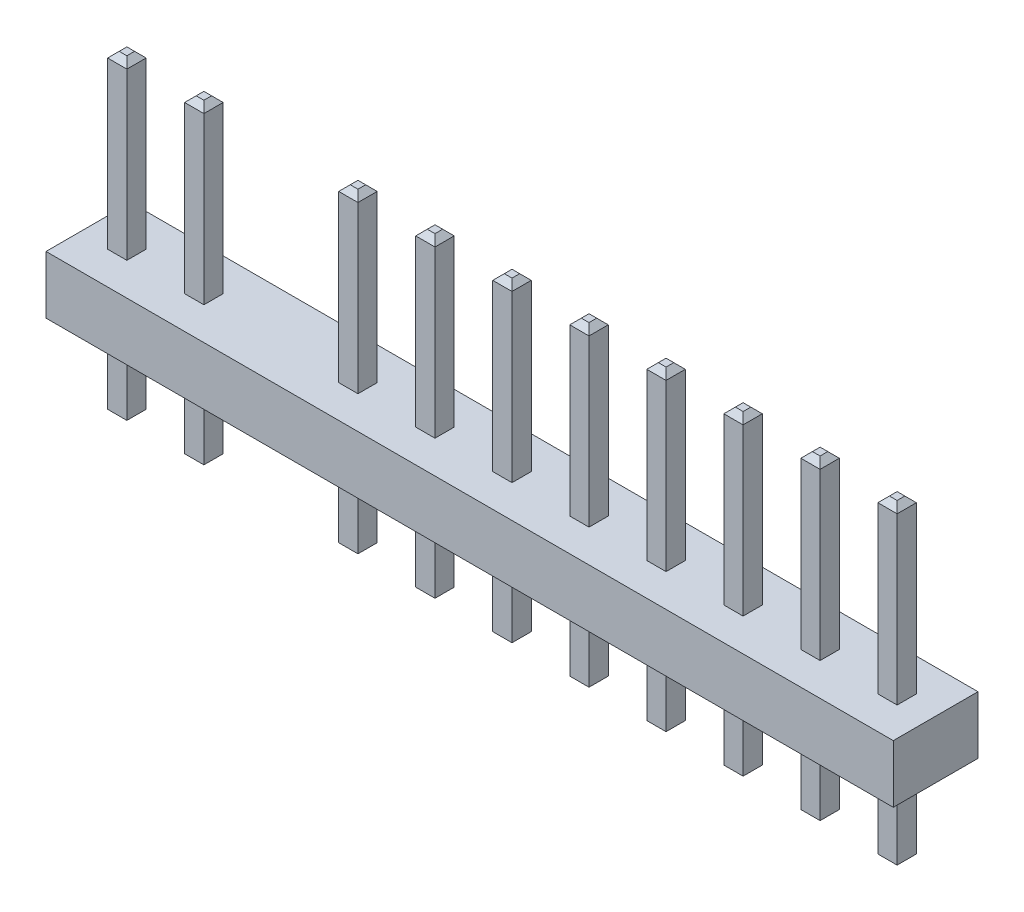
from build123d import *

# Parameters (mm, degrees)
SKETCH1_W                  = 22
SKETCH1_H                  = 2.2
BOSS_EXTRUDE1_DEPTH        = 1.5
BOSS_EXTRUDE2_START        = -3.75
SKETCH2_W                  = 0.5
SKETCH2_H                  = 0.5
BOSS_EXTRUDE2_DEPTH        = 8.2
CHAMFER1_SIZE              = 0.15
LPATTERN1_COUNT            = 11
LPATTERN1_PITCH            = 2
CHAMFER1_OF_LPATTERN1_SIZE = 0.15


with BuildPart() as part:
    # Sketch1 → Boss-Extrude1 (new body)
    with BuildSketch(Plane(origin=(0, 0, 0), x_dir=(1, 0, 0), z_dir=(0, 1, 0))):
        with Locations((11, 1.1)):
            Rectangle(SKETCH1_W, SKETCH1_H)
    extrude(amount=-BOSS_EXTRUDE1_DEPTH)

    # Sketch2 → Boss-Extrude2 (add)
    with BuildSketch(Plane(origin=(0, 0, 0), x_dir=(1, 0, 0), z_dir=(0, 1, 0)).offset(BOSS_EXTRUDE2_START)):
        with Locations((1, 1.1)):
            Rectangle(SKETCH2_W, SKETCH2_H)
    boss_extrude2 = extrude(amount=BOSS_EXTRUDE2_DEPTH)

    # Chamfer1
    chamfer1_edges = [part.edges().sort_by_distance(p)[0] for p in [
        (0.75, -3.75, -1.1),
        (1, -3.75, -1.35),
        (1.25, -3.75, -1.1),
        (1, -3.75, -0.85),
        (0.75, 4.45, -1.1),
        (1, 4.45, -0.85),
        (1.25, 4.45, -1.1),
        (1, 4.45, -1.35),
    ]]
    chamfer(chamfer1_edges, length=CHAMFER1_SIZE)

    # LPattern1: Boss-Extrude2 ×11, 1 skipped
    with Locations(*[(i * LPATTERN1_PITCH, 0, 0) for i in range(1, LPATTERN1_COUNT) if i not in (2,)]):
        add(boss_extrude2)

    # Chamfer1 of LPattern1
    chamfer1_of_lpattern1_edges = [part.edges().sort_by_distance(p)[0] for p in [
        (2.75, -3.75, -1.1),
        (3, -3.75, -1.35),
        (3.25, -3.75, -1.1),
        (3, -3.75, -0.85),
        (2.75, 4.45, -1.1),
        (3, 4.45, -0.85),
        (3.25, 4.45, -1.1),
        (3, 4.45, -1.35),
        (6.75, -3.75, -1.1),
        (7, -3.75, -1.35),
        (7.25, -3.75, -1.1),
        (7, -3.75, -0.85),
        (6.75, 4.45, -1.1),
        (7, 4.45, -0.85),
        (7.25, 4.45, -1.1),
        (7, 4.45, -1.35),
        (8.75, -3.75, -1.1),
        (9, -3.75, -1.35),
        (9.25, -3.75, -1.1),
        (9, -3.75, -0.85),
        (8.75, 4.45, -1.1),
        (9, 4.45, -0.85),
        (9.25, 4.45, -1.1),
        (9, 4.45, -1.35),
        (10.75, -3.75, -1.1),
        (11, -3.75, -1.35),
        (11.25, -3.75, -1.1),
        (11, -3.75, -0.85),
        (10.75, 4.45, -1.1),
        (11, 4.45, -0.85),
        (11.25, 4.45, -1.1),
        (11, 4.45, -1.35),
        (12.75, -3.75, -1.1),
        (13, -3.75, -1.35),
        (13.25, -3.75, -1.1),
        (13, -3.75, -0.85),
        (12.75, 4.45, -1.1),
        (13, 4.45, -0.85),
        (13.25, 4.45, -1.1),
        (13, 4.45, -1.35),
        (14.75, -3.75, -1.1),
        (15, -3.75, -1.35),
        (15.25, -3.75, -1.1),
        (15, -3.75, -0.85),
        (14.75, 4.45, -1.1),
        (15, 4.45, -0.85),
        (15.25, 4.45, -1.1),
        (15, 4.45, -1.35),
        (16.75, -3.75, -1.1),
        (17, -3.75, -1.35),
        (17.25, -3.75, -1.1),
        (17, -3.75, -0.85),
        (16.75, 4.45, -1.1),
        (17, 4.45, -0.85),
        (17.25, 4.45, -1.1),
        (17, 4.45, -1.35),
        (18.75, -3.75, -1.1),
        (19, -3.75, -1.35),
        (19.25, -3.75, -1.1),
        (19, -3.75, -0.85),
        (18.75, 4.45, -1.1),
        (19, 4.45, -0.85),
        (19.25, 4.45, -1.1),
        (19, 4.45, -1.35),
        (20.75, -3.75, -1.1),
        (21, -3.75, -1.35),
        (21.25, -3.75, -1.1),
        (21, -3.75, -0.85),
        (20.75, 4.45, -1.1),
        (21, 4.45, -0.85),
        (21.25, 4.45, -1.1),
        (21, 4.45, -1.35),
    ]]
    chamfer(chamfer1_of_lpattern1_edges, length=CHAMFER1_OF_LPATTERN1_SIZE)


solid = part.part
